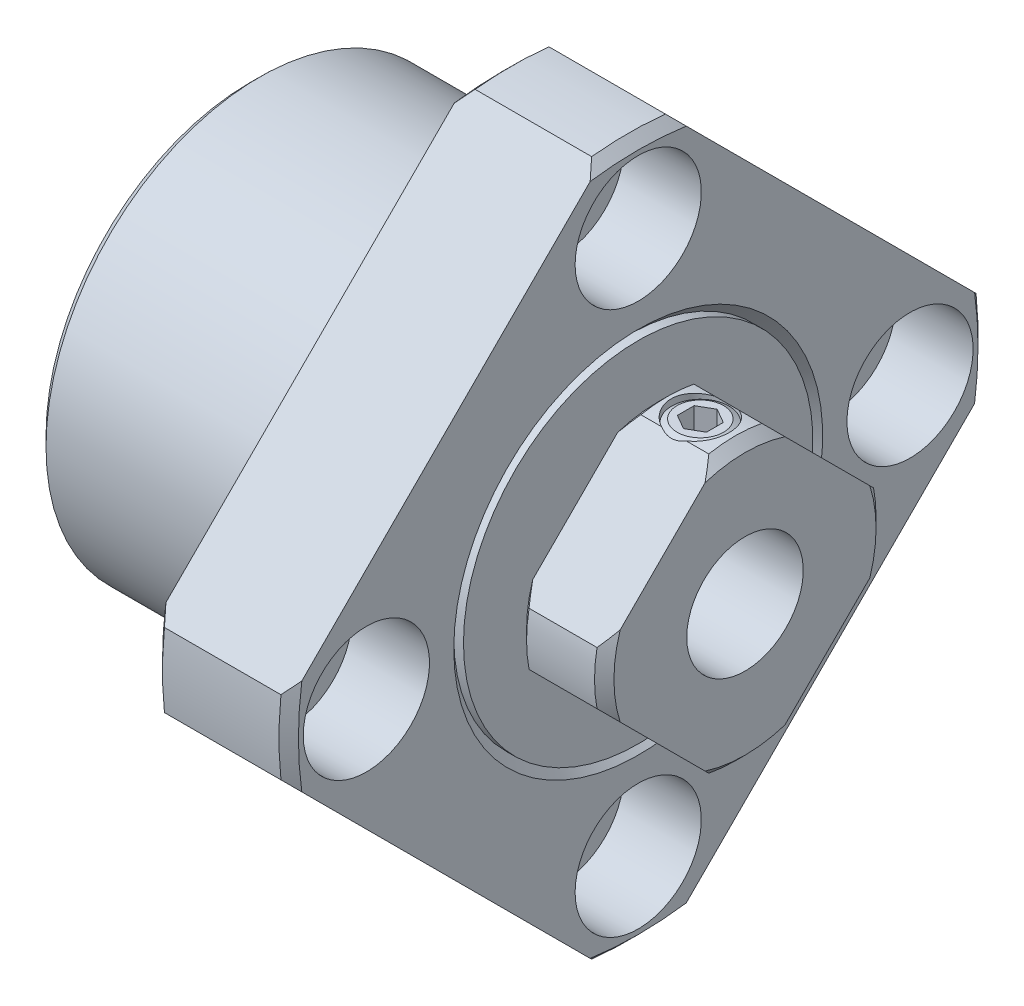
from build123d import *

# Parameters (mm, degrees)
CUT_EXTRUDE1_DEPTH = 5
CUT_EXTRUDE2_DEPTH = 7
CUT_EXTRUDE3_DEPTH = 1.8


with BuildPart() as part:
    # Sketch1 → Revolve1 (revolve)
    with BuildSketch(Plane.XY, mode=Mode.PRIVATE) as revolve1_sk:
        with BuildLine():
            Line((0, 10.5), (0, 9.5))
            Line((0, 9.5), (0.5, 9))
            Line((0.5, 9), (0, 9))
            Line((0, 9), (0, 4.75))
            Line((0, 4.75), (2.5, 4.75))
            Line((2.5, 4.75), (3, 3.883974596))
            Line((3, 3.883974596), (3, 3))
            Line((3, 3), (25.5, 3))
            Line((25.5, 3), (25.5, 6.75))
            Line((25.5, 6.75), (25, 7.25))
            Line((25, 7.25), (21.5, 7.25))
            Line((21.5, 7.25), (21, 6.75))
            Line((21, 6.75), (21, 5))
            Line((21, 5), (20.5, 5))
            Line((20.5, 5), (20.5, 4.5))
            Line((20.5, 4.5), (20, 4.5))
            Line((20, 4.5), (20, 17.5))
            Line((20, 17.5), (19.5, 18))
            Line((19.5, 18), (13.5, 18))
            Line((13.5, 18), (13, 17.5))
            Line((13, 17.5), (13, 11.22))
            ThreePointArc((13, 11.22), (12.935563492, 11.064436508), (12.78, 11))
            Line((12.78, 11), (0.5, 11))
            Line((0.5, 11), (0, 10.5))
        make_face()
    revolve(revolve1_sk.sketch.rotate(Axis((25.5, 0, 0), (-1, 0, 0)), 270), axis=Axis((25.5, 0, 0), (-1, 0, 0)))

    # Sketch2 → Cut-Extrude1 (cut)
    with BuildSketch(Plane(origin=(25.5, 0, 0), x_dir=(0, 0, -1), z_dir=(1, 0, 0))):
        Polygon((-16.970562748, 0), (0, -16.970562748), (16.970562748, 0), (0, 16.970562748), align=None)
        Polygon((-8.485281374, 0), (0, -8.485281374), (8.485281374, 0), (0, 8.485281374), align=None, mode=Mode.SUBTRACT)
    extrude(amount=-CUT_EXTRUDE1_DEPTH, mode=Mode.SUBTRACT)

    # Sketch3 → Cut-Revolve1 (revolve, cut)
    with BuildSketch(Plane.XY, mode=Mode.PRIVATE) as cut_revolve1_sk:
        Polygon((13, 14), (13, 15.7), (16, 15.7), (16, 17.25), (20, 17.25), (20, 14), align=None)
    revolve(cut_revolve1_sk.sketch.rotate(Axis((20, 14, 0), (-1, 0, 0)), 270), axis=Axis((20, 14, 0), (-1, 0, 0)), mode=Mode.SUBTRACT)

    # Sketch4 → Cut-Revolve2 (revolve, cut)
    with BuildSketch(Plane.XY.offset(-14), mode=Mode.PRIVATE) as cut_revolve2_sk:
        Polygon((13, 0), (13, 1.7), (16, 1.7), (16, 3.25), (20, 3.25), (20, 0), align=None)
    revolve(cut_revolve2_sk.sketch.rotate(Axis((20, 0, -14), (-1, 0, 0)), 270), axis=Axis((20, 0, -14), (-1, 0, 0)), mode=Mode.SUBTRACT)

    # Sketch5 → Cut-Revolve3 (revolve, cut)
    with BuildSketch(Plane.XY, mode=Mode.PRIVATE) as cut_revolve3_sk:
        Polygon((13, -14), (13, -12.3), (16, -12.3), (16, -10.75), (20, -10.75), (20, -14), align=None)
    revolve(cut_revolve3_sk.sketch.rotate(Axis((20, -14, 0), (-1, 0, 0)), 270), axis=Axis((20, -14, 0), (-1, 0, 0)), mode=Mode.SUBTRACT)

    # Sketch6 → Cut-Revolve4 (revolve, cut)
    with BuildSketch(Plane.XY.offset(14), mode=Mode.PRIVATE) as cut_revolve4_sk:
        Polygon((13, 0), (13, 1.7), (16, 1.7), (16, 3.25), (20, 3.25), (20, 0), align=None)
    revolve(cut_revolve4_sk.sketch.rotate(Axis((20, 0, 14), (-1, 0, 0)), 270), axis=Axis((20, 0, 14), (-1, 0, 0)), mode=Mode.SUBTRACT)

    # Sketch7 → Cut-Revolve5 (revolve, cut)
    with BuildSketch(Plane.XY, mode=Mode.PRIVATE) as cut_revolve5_sk:
        Polygon((19.5, 9), (20, 9), (20, 9.5), align=None)
    revolve(cut_revolve5_sk.sketch.rotate(Axis((20, 0, 0), (-1, 0, 0)), 270), axis=Axis((20, 0, 0), (-1, 0, 0)), mode=Mode.SUBTRACT)

    # Sketch8 → Cut-Extrude2 (cut)
    with BuildSketch(Plane(origin=(20, 0, 0), x_dir=(0, 0, -1), z_dir=(1, 0, 0))):
        Polygon((-39.597979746, 0), (0, -39.597979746), (39.597979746, 0), (0, 39.597979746), align=None)
        Polygon((-19.798989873, 0), (0, -19.798989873), (19.798989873, 0), (0, 19.798989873), align=None, mode=Mode.SUBTRACT)
    extrude(amount=-CUT_EXTRUDE2_DEPTH, mode=Mode.SUBTRACT)

    # Sketch9 → Cut-Revolve6 (revolve, cut)
    with BuildSketch(Plane.XY, mode=Mode.PRIVATE) as cut_revolve6_sk:
        Polygon((23.2, 7.25), (24.7, 7.25), (24.7, 4.25), (24.67, 4.25), (24.67, 6.940362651), (24.3935, 7.1), (23.2, 7.1), align=None)
    revolve(cut_revolve6_sk.sketch.rotate(Axis((23.2, 7.1, 0), (0, 1, 0)), 270), axis=Axis((23.2, 7.1, 0), (0, 1, 0)), mode=Mode.SUBTRACT)

    # Sketch10 → Cut-Extrude3 (cut)
    with BuildSketch(Plane(origin=(0, 7.1, 0), x_dir=(1, 0, 0), z_dir=(0, 1, 0))):
        Polygon((22.45, 0.433012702), (22.45, -0.433012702), (23.2, -0.866025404), (23.95, -0.433012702), (23.95, 0.433012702), (23.2, 0.866025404), align=None)
    extrude(amount=-CUT_EXTRUDE3_DEPTH, mode=Mode.SUBTRACT)


solid = part.part
